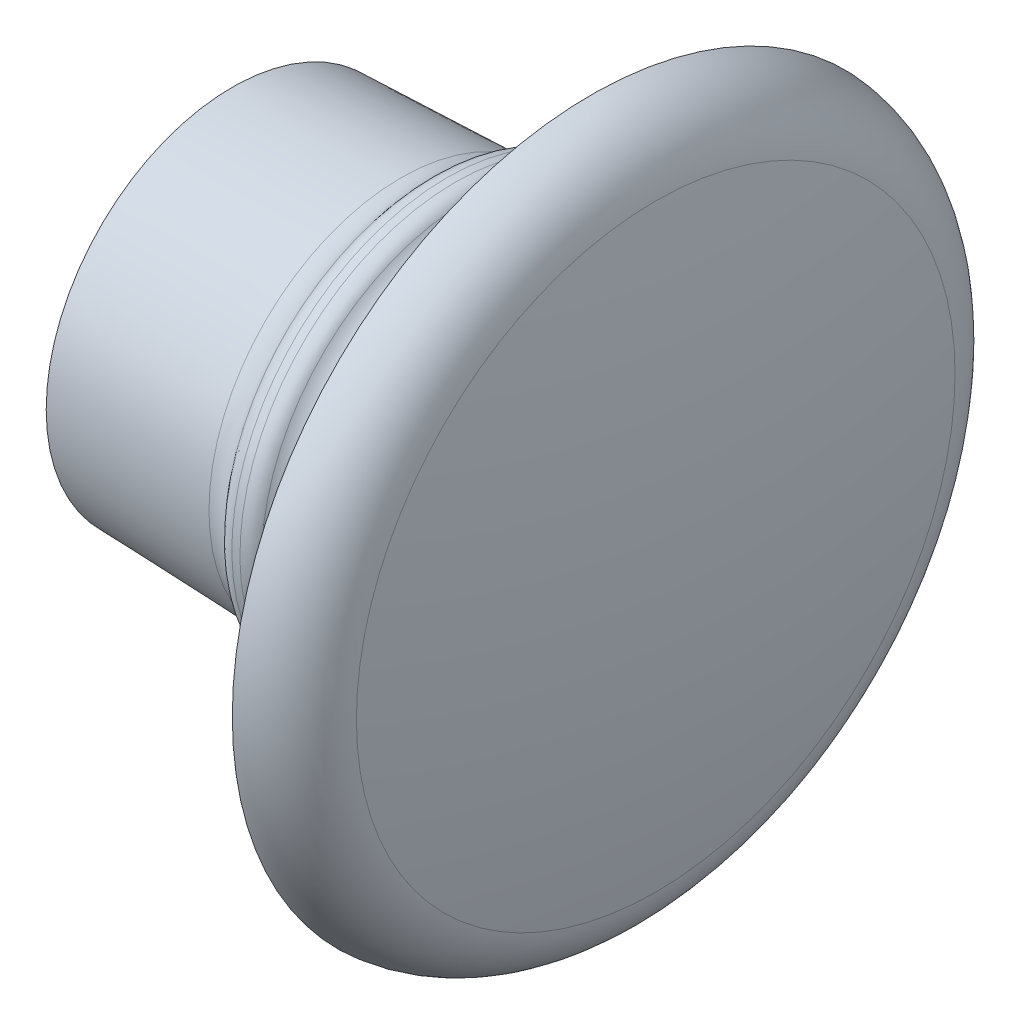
ISO-10303-21;
HEADER;
FILE_DESCRIPTION(('STEP AP214'),'2;1');
FILE_NAME('part.step','',(''),(''),'','','');
FILE_SCHEMA(('AUTOMOTIVE_DESIGN { 1 0 10303 214 1 1 1 1 }'));
ENDSEC;
DATA;
#1=APPLICATION_CONTEXT('core data for automotive mechanical design processes');
#2=APPLICATION_PROTOCOL_DEFINITION('international standard','automotive_design',2000,#1);
#3=PRODUCT_CONTEXT('',#1,'mechanical');
#4=PRODUCT('Part','Part','',(#3));
#5=PRODUCT_RELATED_PRODUCT_CATEGORY('part','',(#4));
#6=PRODUCT_DEFINITION_FORMATION('','',#4);
#7=PRODUCT_DEFINITION_CONTEXT('part definition',#1,'design');
#8=PRODUCT_DEFINITION('design','',#6,#7);
#9=PRODUCT_DEFINITION_SHAPE('','',#8);
#10=(LENGTH_UNIT() NAMED_UNIT(*) SI_UNIT(.MILLI.,.METRE.));
#11=(NAMED_UNIT(*) PLANE_ANGLE_UNIT() SI_UNIT($,.RADIAN.));
#12=(NAMED_UNIT(*) SI_UNIT($,.STERADIAN.) SOLID_ANGLE_UNIT());
#13=UNCERTAINTY_MEASURE_WITH_UNIT(LENGTH_MEASURE(1.E-05),#10,'distance_accuracy_value','');
#14=(GEOMETRIC_REPRESENTATION_CONTEXT(3) GLOBAL_UNCERTAINTY_ASSIGNED_CONTEXT((#13)) GLOBAL_UNIT_ASSIGNED_CONTEXT((#10,
#11,#12)) REPRESENTATION_CONTEXT('',''));
#15=CARTESIAN_POINT('',(0.,0.,0.));
#16=DIRECTION('',(0.,0.,1.));
#17=DIRECTION('',(1.,0.,0.));
#18=AXIS2_PLACEMENT_3D('',#15,#16,#17);
#19=CARTESIAN_POINT('',(10.,0.,0.));
#20=DIRECTION('',(-1.,0.,0.));
#21=DIRECTION('',(0.,0.,1.));
#22=AXIS2_PLACEMENT_3D('',#19,#20,#21);
#23=CYLINDRICAL_SURFACE('',#22,5.35);
#24=CARTESIAN_POINT('',(10.,0.,0.));
#25=DIRECTION('',(-1.,0.,0.));
#26=DIRECTION('',(0.,0.,1.));
#27=AXIS2_PLACEMENT_3D('',#24,#25,#26);
#28=CIRCLE('',#27,5.35);
#29=CARTESIAN_POINT('',(10.,0.,5.35));
#30=VERTEX_POINT('',#29);
#31=EDGE_CURVE('E69',#30,#30,#28,.T.);
#32=ORIENTED_EDGE('',*,*,#31,.T.);
#33=EDGE_LOOP('',(#32));
#34=FACE_BOUND('',#33,.T.);
#35=CARTESIAN_POINT('',(7.5,0.,0.));
#36=DIRECTION('',(-1.,0.,0.));
#37=DIRECTION('',(0.,-1.,0.));
#38=AXIS2_PLACEMENT_3D('',#35,#36,#37);
#39=CIRCLE('',#38,5.35000000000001);
#40=CARTESIAN_POINT('',(7.5,-5.35000000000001,0.));
#41=VERTEX_POINT('',#40);
#42=EDGE_CURVE('E57',#41,#41,#39,.T.);
#43=ORIENTED_EDGE('',*,*,#42,.F.);
#44=EDGE_LOOP('',(#43));
#45=FACE_BOUND('',#44,.T.);
#46=ADVANCED_FACE('F26',(#34,#45),#23,.T.);
#47=CARTESIAN_POINT('',(7.5,0.,0.));
#48=DIRECTION('',(-1.,0.,0.));
#49=DIRECTION('',(0.,-1.,0.));
#50=AXIS2_PLACEMENT_3D('',#47,#48,#49);
#51=TOROIDAL_SURFACE('',#50,6.45000000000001,1.1);
#52=CARTESIAN_POINT('',(6.61488546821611,0.,0.));
#53=DIRECTION('',(1.,0.,0.));
#54=DIRECTION('',(0.,1.,0.));
#55=AXIS2_PLACEMENT_3D('',#52,#53,#54);
#56=CIRCLE('',#55,5.796875);
#57=CARTESIAN_POINT('',(6.61488546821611,5.79687500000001,0.));
#58=VERTEX_POINT('',#57);
#59=EDGE_CURVE('E36',#58,#58,#56,.T.);
#60=ORIENTED_EDGE('',*,*,#59,.T.);
#61=EDGE_LOOP('',(#60));
#62=FACE_BOUND('',#61,.T.);
#63=ORIENTED_EDGE('',*,*,#42,.T.);
#64=EDGE_LOOP('',(#63));
#65=FACE_BOUND('',#64,.T.);
#66=ADVANCED_FACE('F101',(#62,#65),#51,.F.);
#67=CARTESIAN_POINT('',(-2.79962348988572,0.,0.));
#68=DIRECTION('',(-1.,0.,0.));
#69=DIRECTION('',(0.,-1.,0.));
#70=AXIS2_PLACEMENT_3D('',#67,#68,#69);
#71=CYLINDRICAL_SURFACE('',#70,6.);
#72=CARTESIAN_POINT('',(5.98743931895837,0.,0.));
#73=DIRECTION('',(1.,0.,0.));
#74=DIRECTION('',(0.,1.,0.));
#75=AXIS2_PLACEMENT_3D('',#72,#73,#74);
#76=CIRCLE('',#75,6.);
#77=CARTESIAN_POINT('',(5.98743931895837,6.,0.));
#78=VERTEX_POINT('',#77);
#79=EDGE_CURVE('E40',#78,#78,#76,.T.);
#80=ORIENTED_EDGE('',*,*,#79,.T.);
#81=EDGE_LOOP('',(#80));
#82=FACE_BOUND('',#81,.T.);
#83=CARTESIAN_POINT('',(6.21256068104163,0.,0.));
#84=DIRECTION('',(1.,0.,0.));
#85=DIRECTION('',(0.,1.,0.));
#86=AXIS2_PLACEMENT_3D('',#83,#84,#85);
#87=CIRCLE('',#86,6.);
#88=CARTESIAN_POINT('',(6.21256068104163,6.,0.));
#89=VERTEX_POINT('',#88);
#90=EDGE_CURVE('E45',#89,#89,#87,.F.);
#91=ORIENTED_EDGE('',*,*,#90,.T.);
#92=EDGE_LOOP('',(#91));
#93=FACE_BOUND('',#92,.T.);
#94=ADVANCED_FACE('F106',(#82,#93),#71,.T.);
#95=CARTESIAN_POINT('',(4.69999999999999,0.,0.));
#96=DIRECTION('',(-1.,0.,0.));
#97=DIRECTION('',(0.,-1.,0.));
#98=AXIS2_PLACEMENT_3D('',#95,#96,#97);
#99=TOROIDAL_SURFACE('',#98,6.45000000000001,1.1);
#100=CARTESIAN_POINT('',(5.58511453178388,0.,0.));
#101=DIRECTION('',(-1.,0.,0.));
#102=DIRECTION('',(0.,-1.,0.));
#103=AXIS2_PLACEMENT_3D('',#100,#101,#102);
#104=CIRCLE('',#103,5.796875);
#105=CARTESIAN_POINT('',(5.58511453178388,-5.796875,0.));
#106=VERTEX_POINT('',#105);
#107=EDGE_CURVE('E48',#106,#106,#104,.T.);
#108=ORIENTED_EDGE('',*,*,#107,.T.);
#109=EDGE_LOOP('',(#108));
#110=FACE_BOUND('',#109,.T.);
#111=CARTESIAN_POINT('',(4.69999999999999,0.,0.));
#112=DIRECTION('',(-1.,0.,0.));
#113=DIRECTION('',(0.,0.,1.));
#114=AXIS2_PLACEMENT_3D('',#111,#112,#113);
#115=CIRCLE('',#114,5.35000000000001);
#116=CARTESIAN_POINT('',(4.69999999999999,0.,5.35000000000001));
#117=VERTEX_POINT('',#116);
#118=EDGE_CURVE('E66',#117,#117,#115,.T.);
#119=ORIENTED_EDGE('',*,*,#118,.F.);
#120=EDGE_LOOP('',(#119));
#121=FACE_BOUND('',#120,.T.);
#122=ADVANCED_FACE('F138',(#110,#121),#99,.F.);
#123=CARTESIAN_POINT('',(5.98743931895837,0.,0.));
#124=DIRECTION('',(1.,0.,0.));
#125=DIRECTION('',(0.,1.,0.));
#126=AXIS2_PLACEMENT_3D('',#123,#124,#125);
#127=TOROIDAL_SURFACE('',#126,5.5,0.5);
#128=ORIENTED_EDGE('',*,*,#79,.F.);
#129=EDGE_LOOP('',(#128));
#130=FACE_BOUND('',#129,.T.);
#131=ORIENTED_EDGE('',*,*,#107,.F.);
#132=EDGE_LOOP('',(#131));
#133=FACE_BOUND('',#132,.T.);
#134=ADVANCED_FACE('F134',(#130,#133),#127,.T.);
#135=CARTESIAN_POINT('',(6.21256068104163,0.,0.));
#136=DIRECTION('',(1.,0.,0.));
#137=DIRECTION('',(0.,1.,0.));
#138=AXIS2_PLACEMENT_3D('',#135,#136,#137);
#139=TOROIDAL_SURFACE('',#138,5.5,0.5);
#140=ORIENTED_EDGE('',*,*,#59,.F.);
#141=EDGE_LOOP('',(#140));
#142=FACE_BOUND('',#141,.T.);
#143=ORIENTED_EDGE('',*,*,#90,.F.);
#144=EDGE_LOOP('',(#143));
#145=FACE_BOUND('',#144,.T.);
#146=ADVANCED_FACE('F126',(#142,#145),#139,.T.);
#147=CARTESIAN_POINT('',(0.,0.,0.));
#148=DIRECTION('',(1.,0.,0.));
#149=DIRECTION('',(0.,0.,-1.));
#150=AXIS2_PLACEMENT_3D('',#147,#148,#149);
#151=CONICAL_SURFACE('',#150,5.18587238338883,0.0349065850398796);
#152=ORIENTED_EDGE('',*,*,#118,.T.);
#153=EDGE_LOOP('',(#152));
#154=FACE_BOUND('',#153,.T.);
#155=CARTESIAN_POINT('',(0.,0.,0.));
#156=DIRECTION('',(-1.,0.,0.));
#157=DIRECTION('',(0.,0.,1.));
#158=AXIS2_PLACEMENT_3D('',#155,#156,#157);
#159=CIRCLE('',#158,5.18587238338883);
#160=CARTESIAN_POINT('',(0.,0.,5.18587238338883));
#161=VERTEX_POINT('',#160);
#162=EDGE_CURVE('E63',#161,#161,#159,.T.);
#163=ORIENTED_EDGE('',*,*,#162,.F.);
#164=EDGE_LOOP('',(#163));
#165=FACE_BOUND('',#164,.T.);
#166=ADVANCED_FACE('F122',(#154,#165),#151,.T.);
#167=CARTESIAN_POINT('',(-37.5,0.,0.));
#168=DIRECTION('',(1.,0.,0.));
#169=DIRECTION('',(0.,0.,1.));
#170=AXIS2_PLACEMENT_3D('',#167,#168,#169);
#171=SPHERICAL_SURFACE('',#170,48.5);
#172=CARTESIAN_POINT('',(10.9229378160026,0.,0.));
#173=DIRECTION('',(-1.,0.,0.));
#174=DIRECTION('',(0.,0.,1.));
#175=AXIS2_PLACEMENT_3D('',#172,#173,#174);
#176=CIRCLE('',#175,2.73296419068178);
#177=CARTESIAN_POINT('',(10.9229378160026,0.,2.73296419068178));
#178=VERTEX_POINT('',#177);
#179=EDGE_CURVE('E10',#178,#178,#176,.T.);
#180=ORIENTED_EDGE('',*,*,#179,.T.);
#181=EDGE_LOOP('',(#180));
#182=FACE_BOUND('',#181,.T.);
#183=ADVANCED_FACE('F125',(#182),#171,.F.);
#184=CARTESIAN_POINT('',(9.92452672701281,0.,0.));
#185=DIRECTION('',(-1.,0.,0.));
#186=DIRECTION('',(0.,0.,1.));
#187=AXIS2_PLACEMENT_3D('',#184,#185,#186);
#188=TOROIDAL_SURFACE('',#187,2.67661441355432,1.);
#189=ORIENTED_EDGE('',*,*,#179,.F.);
#190=EDGE_LOOP('',(#189));
#191=FACE_BOUND('',#190,.T.);
#192=CARTESIAN_POINT('',(9.94197913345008,0.,0.));
#193=DIRECTION('',(-1.,0.,0.));
#194=DIRECTION('',(0.,0.,1.));
#195=AXIS2_PLACEMENT_3D('',#192,#193,#194);
#196=CIRCLE('',#195,3.67646210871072);
#197=CARTESIAN_POINT('',(9.94197913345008,0.,3.67646210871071));
#198=VERTEX_POINT('',#197);
#199=EDGE_CURVE('E32',#198,#198,#196,.F.);
#200=ORIENTED_EDGE('',*,*,#199,.F.);
#201=EDGE_LOOP('',(#200));
#202=FACE_BOUND('',#201,.T.);
#203=ADVANCED_FACE('F128',(#191,#202),#188,.F.);
#204=CARTESIAN_POINT('',(10.8616729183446,0.,0.));
#205=DIRECTION('',(-1.,0.,0.));
#206=DIRECTION('',(0.,0.,1.));
#207=AXIS2_PLACEMENT_3D('',#204,#205,#206);
#208=CONICAL_SURFACE('',#207,3.66040879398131,0.0174532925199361);
#209=ORIENTED_EDGE('',*,*,#199,.T.);
#210=EDGE_LOOP('',(#209));
#211=FACE_BOUND('',#210,.T.);
#212=CARTESIAN_POINT('',(0.,0.,0.));
#213=DIRECTION('',(1.,0.,0.));
#214=DIRECTION('',(0.,0.,-1.));
#215=AXIS2_PLACEMENT_3D('',#212,#213,#214);
#216=CIRCLE('',#215,3.85);
#217=CARTESIAN_POINT('',(0.,0.,-3.85));
#218=VERTEX_POINT('',#217);
#219=EDGE_CURVE('E60',#218,#218,#216,.T.);
#220=ORIENTED_EDGE('',*,*,#219,.F.);
#221=EDGE_LOOP('',(#220));
#222=FACE_BOUND('',#221,.T.);
#223=ADVANCED_FACE('F119',(#211,#222),#208,.F.);
#224=CARTESIAN_POINT('',(0.,0.,0.));
#225=DIRECTION('',(1.,0.,0.));
#226=DIRECTION('',(0.,0.,-1.));
#227=AXIS2_PLACEMENT_3D('',#224,#225,#226);
#228=PLANE('',#227);
#229=ORIENTED_EDGE('',*,*,#219,.T.);
#230=EDGE_LOOP('',(#229));
#231=FACE_BOUND('',#230,.T.);
#232=ORIENTED_EDGE('',*,*,#162,.T.);
#233=EDGE_LOOP('',(#232));
#234=FACE_BOUND('',#233,.T.);
#235=ADVANCED_FACE('F114',(#231,#234),#228,.F.);
#236=CARTESIAN_POINT('',(10.,0.,0.));
#237=DIRECTION('',(-1.,0.,0.));
#238=DIRECTION('',(0.,0.,1.));
#239=AXIS2_PLACEMENT_3D('',#236,#237,#238);
#240=TOROIDAL_SURFACE('',#239,5.85,0.5);
#241=CARTESIAN_POINT('',(10.3706921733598,0.,0.));
#242=DIRECTION('',(-1.,0.,0.));
#243=DIRECTION('',(0.,0.,1.));
#244=AXIS2_PLACEMENT_3D('',#241,#242,#243);
#245=CIRCLE('',#244,6.18554032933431);
#246=CARTESIAN_POINT('',(10.3706921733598,0.,6.18554032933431));
#247=VERTEX_POINT('',#246);
#248=EDGE_CURVE('E78',#247,#247,#245,.T.);
#249=ORIENTED_EDGE('',*,*,#248,.T.);
#250=EDGE_LOOP('',(#249));
#251=FACE_BOUND('',#250,.T.);
#252=ORIENTED_EDGE('',*,*,#31,.F.);
#253=EDGE_LOOP('',(#252));
#254=FACE_BOUND('',#253,.T.);
#255=ADVANCED_FACE('F82',(#251,#254),#240,.F.);
#256=CARTESIAN_POINT('',(11.,0.,0.));
#257=DIRECTION('',(-1.,0.,0.));
#258=DIRECTION('',(0.,0.,1.));
#259=AXIS2_PLACEMENT_3D('',#256,#257,#258);
#260=TOROIDAL_SURFACE('',#259,6.97265181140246,0.999999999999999);
#261=CARTESIAN_POINT('',(10.,0.,0.));
#262=DIRECTION('',(-1.,0.,0.));
#263=DIRECTION('',(0.,0.,1.));
#264=AXIS2_PLACEMENT_3D('',#261,#262,#263);
#265=CIRCLE('',#264,6.97265181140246);
#266=CARTESIAN_POINT('',(10.,0.,6.97265181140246));
#267=VERTEX_POINT('',#266);
#268=EDGE_CURVE('E72',#267,#267,#265,.T.);
#269=ORIENTED_EDGE('',*,*,#268,.T.);
#270=EDGE_LOOP('',(#269));
#271=FACE_BOUND('',#270,.T.);
#272=CARTESIAN_POINT('',(10.2836236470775,0.,0.));
#273=DIRECTION('',(-1.,0.,0.));
#274=DIRECTION('',(0.,0.,1.));
#275=AXIS2_PLACEMENT_3D('',#272,#273,#274);
#276=CIRCLE('',#275,6.27493774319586);
#277=CARTESIAN_POINT('',(10.2836236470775,0.,6.27493774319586));
#278=VERTEX_POINT('',#277);
#279=EDGE_CURVE('E75',#278,#278,#276,.T.);
#280=ORIENTED_EDGE('',*,*,#279,.F.);
#281=EDGE_LOOP('',(#280));
#282=FACE_BOUND('',#281,.T.);
#283=ADVANCED_FACE('F88',(#271,#282),#260,.T.);
#284=CARTESIAN_POINT('',(10.3706921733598,0.,0.));
#285=DIRECTION('',(-1.,0.,0.));
#286=DIRECTION('',(0.,0.,1.));
#287=AXIS2_PLACEMENT_3D('',#284,#285,#286);
#288=CONICAL_SURFACE('',#287,6.18554032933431,0.798594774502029);
#289=ORIENTED_EDGE('',*,*,#279,.T.);
#290=EDGE_LOOP('',(#289));
#291=FACE_BOUND('',#290,.T.);
#292=ORIENTED_EDGE('',*,*,#248,.F.);
#293=EDGE_LOOP('',(#292));
#294=FACE_BOUND('',#293,.T.);
#295=ADVANCED_FACE('F85',(#291,#294),#288,.F.);
#296=CARTESIAN_POINT('',(-37.5,0.,0.));
#297=DIRECTION('',(-1.,0.,0.));
#298=DIRECTION('',(0.,0.,-1.));
#299=AXIS2_PLACEMENT_3D('',#296,#297,#298);
#300=SPHERICAL_SURFACE('',#299,50.);
#301=CARTESIAN_POINT('',(11.7993500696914,0.,0.));
#302=DIRECTION('',(-1.,0.,0.));
#303=DIRECTION('',(0.,0.,1.));
#304=AXIS2_PLACEMENT_3D('',#301,#302,#303);
#305=CIRCLE('',#304,8.34110800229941);
#306=CARTESIAN_POINT('',(11.7993500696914,0.,8.34110800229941));
#307=VERTEX_POINT('',#306);
#308=EDGE_CURVE('E51',#307,#307,#305,.F.);
#309=ORIENTED_EDGE('',*,*,#308,.T.);
#310=EDGE_LOOP('',(#309));
#311=FACE_BOUND('',#310,.T.);
#312=ADVANCED_FACE('F87',(#311),#300,.T.);
#313=CARTESIAN_POINT('',(9.82737606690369,0.,0.));
#314=DIRECTION('',(1.,0.,0.));
#315=DIRECTION('',(0.,0.,-1.));
#316=AXIS2_PLACEMENT_3D('',#313,#314,#315);
#317=TOROIDAL_SURFACE('',#316,8.00746368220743,2.);
#318=ORIENTED_EDGE('',*,*,#308,.F.);
#319=EDGE_LOOP('',(#318));
#320=FACE_BOUND('',#319,.T.);
#321=CARTESIAN_POINT('',(10.,0.,0.));
#322=DIRECTION('',(-1.,0.,0.));
#323=DIRECTION('',(0.,0.,1.));
#324=AXIS2_PLACEMENT_3D('',#321,#322,#323);
#325=CIRCLE('',#324,10.);
#326=CARTESIAN_POINT('',(10.,0.,10.));
#327=VERTEX_POINT('',#326);
#328=EDGE_CURVE('E54',#327,#327,#325,.T.);
#329=ORIENTED_EDGE('',*,*,#328,.F.);
#330=EDGE_LOOP('',(#329));
#331=FACE_BOUND('',#330,.T.);
#332=ADVANCED_FACE('F95',(#320,#331),#317,.T.);
#333=CARTESIAN_POINT('',(10.,0.,0.));
#334=DIRECTION('',(1.,0.,0.));
#335=DIRECTION('',(0.,0.,-1.));
#336=AXIS2_PLACEMENT_3D('',#333,#334,#335);
#337=PLANE('',#336);
#338=ORIENTED_EDGE('',*,*,#268,.F.);
#339=EDGE_LOOP('',(#338));
#340=FACE_BOUND('',#339,.T.);
#341=ORIENTED_EDGE('',*,*,#328,.T.);
#342=EDGE_LOOP('',(#341));
#343=FACE_BOUND('',#342,.T.);
#344=ADVANCED_FACE('F142',(#340,#343),#337,.F.);
#345=CLOSED_SHELL('',(#46,#66,#94,#122,#134,#146,#166,#183,#203,#223,#235,#255,#283,#295,#312,
#332,#344));
#346=MANIFOLD_SOLID_BREP('B2',#345);
#347=ADVANCED_BREP_SHAPE_REPRESENTATION('',(#18,#346),#14);
#348=SHAPE_DEFINITION_REPRESENTATION(#9,#347);
ENDSEC;
END-ISO-10303-21;
